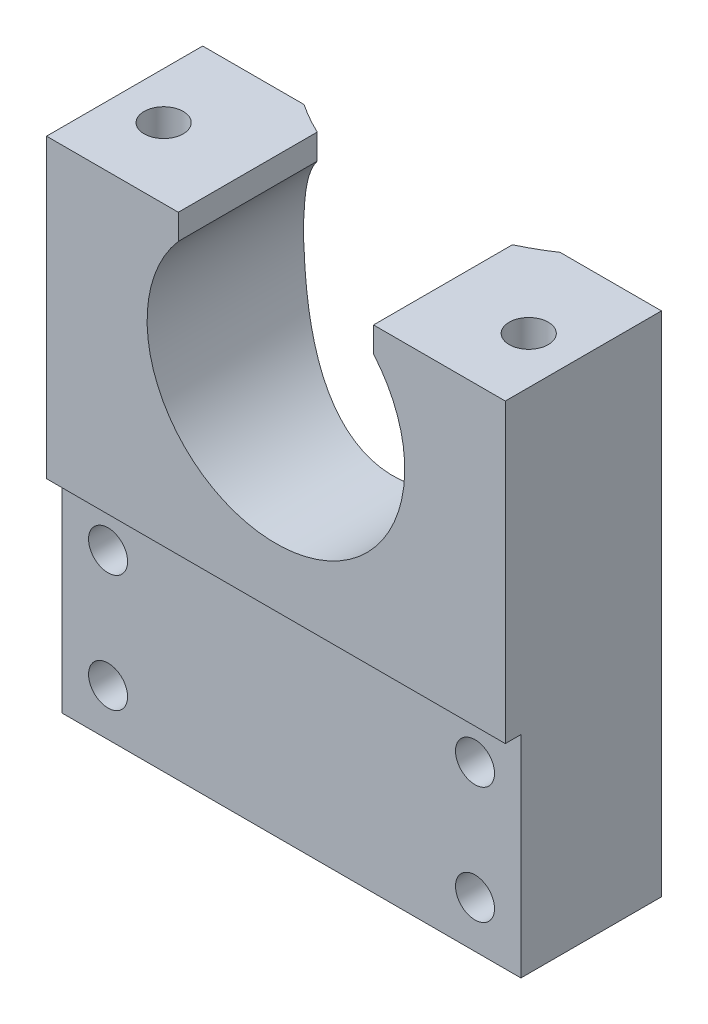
from build123d import *

# Parameters (mm, degrees)
BOSS_EXTRUDE1_DEPTH               = 82.55
SKETCH2_W                         = 88.9
SKETCH2_H                         = 45.72
CUT_EXTRUDE1_DEPTH                = 107.693370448
CUT_EXTRUDE3_DEPTH                = 95.084497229
SKETCH6_W                         = 74.6252
SKETCH6_H                         = 34.29
CUT_EXTRUDE4_DEPTH                = 2.54
F_1_4_20_TAPPED_HOLE1_D           = 6.35
F_1_4_20_TAPPED_HOLE2_D           = 5.1054
F_1_4_20_TAPPED_HOLE2_DEPTH       = 31.75
F_1_4_20_TAPPED_HOLE2_CBORE_D     = 6.35
F_1_4_20_TAPPED_HOLE2_CBORE_DEPTH = 25.4
F_1_4_20_TAPPED_HOLE2_TIP         = 1.533816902


with BuildPart() as part:
    # Sketch1 → Boss-Extrude1 (new body)
    with BuildSketch(Plane(origin=(0, 0, 0), x_dir=(1, 0, 0), z_dir=(0, 1, 0))):
        with BuildLine():
            Line((37.3126, 0), (-37.3126, 0))
            Line((-37.3126, 0), (-37.3126, 56.3626))
            ThreePointArc((-37.3126, 56.3626), (0, 19.05), (37.3126, 56.3626))
            Line((37.3126, 56.3626), (37.3126, 0))
        make_face()
    extrude(amount=BOSS_EXTRUDE1_DEPTH)

    # Sketch2 → Cut-Extrude1 (cut, through all)
    with BuildSketch(Plane(origin=(0, 82.55, 0), x_dir=(1, 0, 0), z_dir=(0, 1, 0))):
        with Locations((0, 48.26)):
            Rectangle(SKETCH2_W, SKETCH2_H)
    extrude(amount=-CUT_EXTRUDE1_DEPTH, mode=Mode.SUBTRACT)

    # Sketch4 → Cut-Extrude3 (cut, through all)
    with BuildSketch(Plane.XY):
        with BuildLine():
            Line((-15.875, 78.44831861), (-15.875, 82.55))
            Line((-15.875, 82.55), (15.875, 82.55))
            Line((15.875, 82.55), (15.875, 78.44831861))
            ThreePointArc((15.875, 78.44831861), (0, 43.815), (-15.875, 78.44831861))
        make_face()
    extrude(amount=-CUT_EXTRUDE3_DEPTH, mode=Mode.SUBTRACT)

    # Sketch6 → Cut-Extrude4 (cut)
    with BuildSketch(Plane.XY):
        with Locations((0, 17.145)):
            Rectangle(SKETCH6_W, SKETCH6_H)
    extrude(amount=-CUT_EXTRUDE4_DEPTH, mode=Mode.SUBTRACT)

    # 1_4-20 Tapped Hole1 (through all)
    with Locations(Plane.XY.offset(-2.54)):
        with Locations((-29.845, 26.67), (-29.845, 7.62), (29.845, 7.62), (29.845, 26.67)):
            Hole(F_1_4_20_TAPPED_HOLE1_D / 2)

    # 1_4-20 Tapped Hole2
    with Locations(Plane(origin=(0, 82.55, 0), x_dir=(-1, 0, 0), z_dir=(0, 1, 0))):
        with Locations((29.6926, -11.43), (-29.6926, -11.43)):
            CounterBoreHole(F_1_4_20_TAPPED_HOLE2_D / 2, F_1_4_20_TAPPED_HOLE2_CBORE_D / 2, F_1_4_20_TAPPED_HOLE2_CBORE_DEPTH, depth=F_1_4_20_TAPPED_HOLE2_DEPTH)
            with Locations((0, 0, -(F_1_4_20_TAPPED_HOLE2_DEPTH + F_1_4_20_TAPPED_HOLE2_TIP / 2))):  # 118° drill point
                Cone(0, F_1_4_20_TAPPED_HOLE2_D / 2, F_1_4_20_TAPPED_HOLE2_TIP, mode=Mode.SUBTRACT)


solid = part.part
